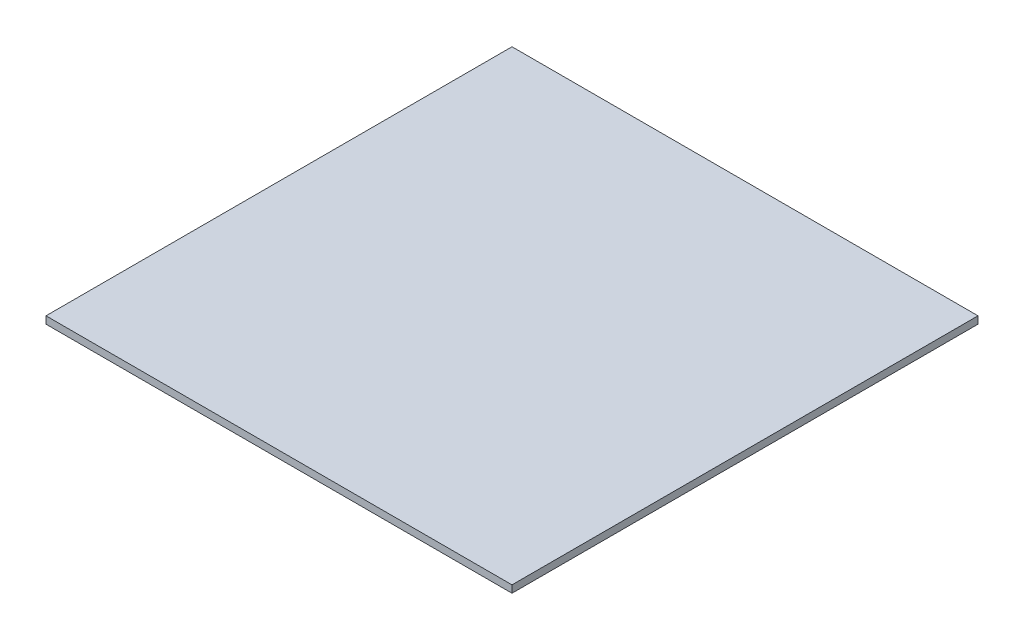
from build123d import *

# Parameters (mm, degrees)
SKETCH1_W      = 1219.2
SKETCH1_H      = 1219.2
EXTRUDE1_DEPTH = 19.05


with BuildPart() as part:
    # Sketch1 → Extrude1 (new body)
    with BuildSketch(Plane(origin=(0, 0, 0), x_dir=(1, 0, 0), z_dir=(0, 1, 0))):
        Rectangle(SKETCH1_W, SKETCH1_H)
    extrude(amount=EXTRUDE1_DEPTH)


solid = part.part
